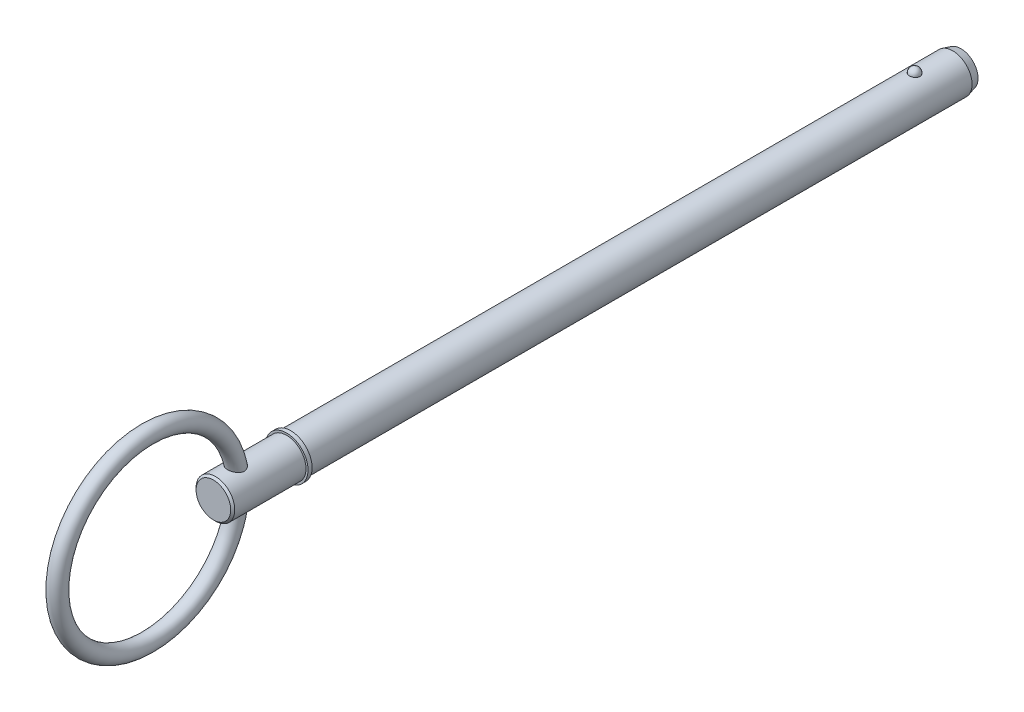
ISO-10303-21;
HEADER;
FILE_DESCRIPTION(('STEP AP214'),'2;1');
FILE_NAME('part.step','',(''),(''),'','','');
FILE_SCHEMA(('AUTOMOTIVE_DESIGN { 1 0 10303 214 1 1 1 1 }'));
ENDSEC;
DATA;
#1=APPLICATION_CONTEXT('core data for automotive mechanical design processes');
#2=APPLICATION_PROTOCOL_DEFINITION('international standard','automotive_design',2000,#1);
#3=PRODUCT_CONTEXT('',#1,'mechanical');
#4=PRODUCT('Part','Part','',(#3));
#5=PRODUCT_RELATED_PRODUCT_CATEGORY('part','',(#4));
#6=PRODUCT_DEFINITION_FORMATION('','',#4);
#7=PRODUCT_DEFINITION_CONTEXT('part definition',#1,'design');
#8=PRODUCT_DEFINITION('design','',#6,#7);
#9=PRODUCT_DEFINITION_SHAPE('','',#8);
#10=(LENGTH_UNIT() NAMED_UNIT(*) SI_UNIT(.MILLI.,.METRE.));
#11=(NAMED_UNIT(*) PLANE_ANGLE_UNIT() SI_UNIT($,.RADIAN.));
#12=(NAMED_UNIT(*) SI_UNIT($,.STERADIAN.) SOLID_ANGLE_UNIT());
#13=UNCERTAINTY_MEASURE_WITH_UNIT(LENGTH_MEASURE(1.E-05),#10,'distance_accuracy_value','');
#14=(GEOMETRIC_REPRESENTATION_CONTEXT(3) GLOBAL_UNCERTAINTY_ASSIGNED_CONTEXT((#13)) GLOBAL_UNIT_ASSIGNED_CONTEXT((#10,
#11,#12)) REPRESENTATION_CONTEXT('',''));
#15=CARTESIAN_POINT('',(0.,0.,0.));
#16=DIRECTION('',(0.,0.,1.));
#17=DIRECTION('',(1.,0.,0.));
#18=AXIS2_PLACEMENT_3D('',#15,#16,#17);
#19=CARTESIAN_POINT('',(0.,0.,152.4));
#20=DIRECTION('',(0.,0.,-1.));
#21=DIRECTION('',(-1.,0.,0.));
#22=AXIS2_PLACEMENT_3D('',#19,#20,#21);
#23=CYLINDRICAL_SURFACE('',#22,4.765);
#24=CARTESIAN_POINT('',(1.27812710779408,4.59038300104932,-1.29));
#25=CARTESIAN_POINT('',(1.27812572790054,4.59038414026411,-1.21786886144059));
#26=CARTESIAN_POINT('',(1.27223018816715,4.59203736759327,-1.14572000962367));
#27=CARTESIAN_POINT('',(1.24878929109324,4.59846646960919,-1.00346315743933));
#28=CARTESIAN_POINT('',(1.23123896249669,4.60324367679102,-0.933356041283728));
#29=CARTESIAN_POINT('',(1.18493861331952,4.61537801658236,-0.797215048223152));
#30=CARTESIAN_POINT('',(1.15619354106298,4.62273400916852,-0.731179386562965));
#31=CARTESIAN_POINT('',(1.08822596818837,4.6392032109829,-0.604986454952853));
#32=CARTESIAN_POINT('',(1.04900384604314,4.64831635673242,-0.54482897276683));
#33=CARTESIAN_POINT('',(0.960865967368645,4.66733302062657,-0.431775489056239));
#34=CARTESIAN_POINT('',(0.911906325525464,4.67723999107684,-0.378914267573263));
#35=CARTESIAN_POINT('',(0.805678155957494,4.69670280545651,-0.282245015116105));
#36=CARTESIAN_POINT('',(0.748409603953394,4.70625864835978,-0.238437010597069));
#37=CARTESIAN_POINT('',(0.627266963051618,4.72392767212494,-0.161207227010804));
#38=CARTESIAN_POINT('',(0.563411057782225,4.73204466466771,-0.127757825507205));
#39=CARTESIAN_POINT('',(0.430755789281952,4.74595788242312,-0.0720471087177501));
#40=CARTESIAN_POINT('',(0.361956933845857,4.75175434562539,-0.0497846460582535));
#41=CARTESIAN_POINT('',(0.222605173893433,4.76030056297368,-0.0173750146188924));
#42=CARTESIAN_POINT('',(0.152101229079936,4.76309991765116,-0.00703038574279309));
#43=CARTESIAN_POINT('',(0.0103009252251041,4.76551622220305,0.00191361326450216));
#44=CARTESIAN_POINT('',(-0.06099536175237,4.76513345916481,0.000514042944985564));
#45=CARTESIAN_POINT('',(-0.201348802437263,4.76125496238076,-0.0138891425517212));
#46=CARTESIAN_POINT('',(-0.270423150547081,4.75780093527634,-0.0267372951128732));
#47=CARTESIAN_POINT('',(-0.405377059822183,4.74820737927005,-0.0634598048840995));
#48=CARTESIAN_POINT('',(-0.471256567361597,4.74206780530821,-0.0873343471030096));
#49=CARTESIAN_POINT('',(-0.598375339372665,4.72771507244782,-0.14561183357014));
#50=CARTESIAN_POINT('',(-0.659587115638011,4.71949070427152,-0.180071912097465));
#51=CARTESIAN_POINT('',(-0.775356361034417,4.70185936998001,-0.258542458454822));
#52=CARTESIAN_POINT('',(-0.829913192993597,4.69245229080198,-0.30255383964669));
#53=CARTESIAN_POINT('',(-0.931895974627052,4.67327936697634,-0.399829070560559));
#54=CARTESIAN_POINT('',(-0.979176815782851,4.66351011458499,-0.453244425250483));
#55=CARTESIAN_POINT('',(-1.06421220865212,4.64484426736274,-0.567321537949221));
#56=CARTESIAN_POINT('',(-1.10196613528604,4.63594772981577,-0.627983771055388));
#57=CARTESIAN_POINT('',(-1.16735225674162,4.61992036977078,-0.755585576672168));
#58=CARTESIAN_POINT('',(-1.19487251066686,4.61280933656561,-0.822585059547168));
#59=CARTESIAN_POINT('',(-1.23851975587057,4.60128324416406,-0.960417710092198));
#60=CARTESIAN_POINT('',(-1.25464705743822,4.59686811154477,-1.03125077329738));
#61=CARTESIAN_POINT('',(-1.27505790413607,4.59124882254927,-1.17443804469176));
#62=CARTESIAN_POINT('',(-1.27938868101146,4.59003186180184,-1.246785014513));
#63=CARTESIAN_POINT('',(-1.27623192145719,4.5909105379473,-1.39119892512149));
#64=CARTESIAN_POINT('',(-1.26874468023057,4.59300609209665,-1.46326587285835));
#65=CARTESIAN_POINT('',(-1.24220427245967,4.60025423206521,-1.60473192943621));
#66=CARTESIAN_POINT('',(-1.2232043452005,4.60539274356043,-1.67414176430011));
#67=CARTESIAN_POINT('',(-1.1741591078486,4.61813957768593,-1.80870154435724));
#68=CARTESIAN_POINT('',(-1.1441133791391,4.62574799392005,-1.87385132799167));
#69=CARTESIAN_POINT('',(-1.07354327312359,4.64263368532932,-1.99841604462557));
#70=CARTESIAN_POINT('',(-1.03296580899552,4.65191934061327,-2.05779976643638));
#71=CARTESIAN_POINT('',(-0.942433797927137,4.67110036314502,-2.16881966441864));
#72=CARTESIAN_POINT('',(-0.892478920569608,4.68099575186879,-2.22045556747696));
#73=CARTESIAN_POINT('',(-0.784302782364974,4.70033161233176,-2.31471696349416));
#74=CARTESIAN_POINT('',(-0.726054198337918,4.70977043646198,-2.35731146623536));
#75=CARTESIAN_POINT('',(-0.602997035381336,4.72709995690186,-2.43206620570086));
#76=CARTESIAN_POINT('',(-0.538188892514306,4.73499075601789,-2.46422713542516));
#77=CARTESIAN_POINT('',(-0.404639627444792,4.7482563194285,-2.5168745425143));
#78=CARTESIAN_POINT('',(-0.335953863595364,4.7536596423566,-2.53749415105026));
#79=CARTESIAN_POINT('',(-0.195948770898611,4.76148510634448,-2.5670372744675));
#80=CARTESIAN_POINT('',(-0.124629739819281,4.76390758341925,-2.5759621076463));
#81=CARTESIAN_POINT('',(0.0172696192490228,4.76548774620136,-2.5818033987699));
#82=CARTESIAN_POINT('',(0.0878407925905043,4.76470225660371,-2.57892886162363));
#83=CARTESIAN_POINT('',(0.227467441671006,4.76008019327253,-2.561726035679));
#84=CARTESIAN_POINT('',(0.296522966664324,4.75624371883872,-2.5473981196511));
#85=CARTESIAN_POINT('',(0.430942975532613,4.74595041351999,-2.50776251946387));
#86=CARTESIAN_POINT('',(0.496319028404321,4.7395023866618,-2.4824917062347));
#87=CARTESIAN_POINT('',(0.621860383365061,4.72467083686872,-2.42167301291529));
#88=CARTESIAN_POINT('',(0.682025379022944,4.71628720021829,-2.38612452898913));
#89=CARTESIAN_POINT('',(0.796409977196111,4.69833598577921,-2.30511163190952));
#90=CARTESIAN_POINT('',(0.850529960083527,4.68875291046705,-2.25951003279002));
#91=CARTESIAN_POINT('',(0.950412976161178,4.66953243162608,-2.15992428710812));
#92=CARTESIAN_POINT('',(0.996174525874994,4.65989501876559,-2.1059386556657));
#93=CARTESIAN_POINT('',(1.07885962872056,4.64145616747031,-1.99009376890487));
#94=CARTESIAN_POINT('',(1.11562789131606,4.63267081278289,-1.92812106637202));
#95=CARTESIAN_POINT('',(1.17840570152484,4.61710269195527,-1.79873681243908));
#96=CARTESIAN_POINT('',(1.20441973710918,4.61031909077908,-1.73132754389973));
#97=CARTESIAN_POINT('',(1.24242116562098,4.60021170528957,-1.60192906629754));
#98=CARTESIAN_POINT('',(1.25578772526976,4.59655387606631,-1.54036674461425));
#99=CARTESIAN_POINT('',(1.27364121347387,4.59163904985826,-1.41587409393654));
#100=CARTESIAN_POINT('',(1.2781283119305,4.59038200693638,-1.35294379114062));
#101=CARTESIAN_POINT('',(1.27812710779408,4.59038300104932,-1.29));
#102=B_SPLINE_CURVE_WITH_KNOTS('',3,(#24,#25,#26,#27,#28,#29,#30,#31,#32,#33,#34,#35,#36,#37,
#38,#39,#40,#41,#42,#43,#44,#45,#46,#47,#48,#49,#50,#51,#52,#53,#54,#55,#56,#57,#58,#59,#60,#61,
#62,#63,#64,#65,#66,#67,#68,#69,#70,#71,#72,#73,#74,#75,#76,#77,#78,#79,#80,#81,#82,#83,#84,#85,
#86,#87,#88,#89,#90,#91,#92,#93,#94,#95,#96,#97,#98,#99,#100,#101),.UNSPECIFIED.,.T.,.F.,(4,2,2,
2,2,2,2,2,2,2,2,2,2,2,2,2,2,2,2,2,2,2,2,2,2,2,2,2,2,2,2,2,2,2,2,2,2,2,4),(0.,0.216167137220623,
0.432426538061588,0.648590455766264,0.8647465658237,1.0818998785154,1.29905382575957,
1.51562361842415,1.73217119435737,1.94507683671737,2.15796327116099,2.36800220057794,
2.57804465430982,2.78924132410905,3.00045819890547,3.21545551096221,3.43046692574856,
3.64776550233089,3.8650581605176,4.08147951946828,4.29789547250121,4.51331818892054,
4.72874907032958,4.94528769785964,5.16183395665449,5.37911087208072,5.59637335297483,
5.8110751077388,6.02575265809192,6.23664413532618,6.44752874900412,6.65770827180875,
6.86790014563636,7.08116060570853,7.29445887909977,7.51121476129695,7.72788009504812,
7.91651762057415,8.10515153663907),.UNSPECIFIED.);
#103=CARTESIAN_POINT('',(1.27812710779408,4.59038300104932,-1.29));
#104=VERTEX_POINT('',#103);
#105=EDGE_CURVE('E101',#104,#104,#102,.T.);
#106=ORIENTED_EDGE('',*,*,#105,.T.);
#107=EDGE_LOOP('',(#106));
#108=FACE_BOUND('',#107,.T.);
#109=CARTESIAN_POINT('',(0.,0.,-10.7000000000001));
#110=DIRECTION('',(0.,0.,-1.));
#111=DIRECTION('',(-1.,0.,0.));
#112=AXIS2_PLACEMENT_3D('',#109,#110,#111);
#113=CIRCLE('',#112,4.765);
#114=CARTESIAN_POINT('',(-4.765,0.,-10.7000000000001));
#115=VERTEX_POINT('',#114);
#116=EDGE_CURVE('E109',#115,#115,#113,.F.);
#117=ORIENTED_EDGE('',*,*,#116,.T.);
#118=EDGE_LOOP('',(#117));
#119=FACE_BOUND('',#118,.T.);
#120=CARTESIAN_POINT('',(0.,0.,152.4));
#121=DIRECTION('',(0.,0.,1.));
#122=DIRECTION('',(1.,0.,0.));
#123=AXIS2_PLACEMENT_3D('',#120,#121,#122);
#124=CIRCLE('',#123,4.765);
#125=CARTESIAN_POINT('',(4.765,0.,152.4));
#126=VERTEX_POINT('',#125);
#127=EDGE_CURVE('E107',#126,#126,#124,.T.);
#128=ORIENTED_EDGE('',*,*,#127,.F.);
#129=EDGE_LOOP('',(#128));
#130=FACE_BOUND('',#129,.T.);
#131=ADVANCED_FACE('F39',(#108,#119,#130),#23,.T.);
#132=CARTESIAN_POINT('',(0.,0.,-12.7));
#133=DIRECTION('',(0.,0.,-1.));
#134=DIRECTION('',(-1.,0.,0.));
#135=AXIS2_PLACEMENT_3D('',#132,#133,#134);
#136=PLANE('',#135);
#137=CARTESIAN_POINT('',(0.,0.,-12.7));
#138=DIRECTION('',(0.,0.,-1.));
#139=DIRECTION('',(-1.,0.,0.));
#140=AXIS2_PLACEMENT_3D('',#137,#138,#139);
#141=CIRCLE('',#140,4.22910161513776);
#142=CARTESIAN_POINT('',(-4.22910161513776,0.,-12.7));
#143=VERTEX_POINT('',#142);
#144=EDGE_CURVE('E142',#143,#143,#141,.T.);
#145=ORIENTED_EDGE('',*,*,#144,.T.);
#146=EDGE_LOOP('',(#145));
#147=FACE_BOUND('',#146,.T.);
#148=ADVANCED_FACE('F87',(#147),#136,.T.);
#149=CARTESIAN_POINT('',(0.,0.,-12.7));
#150=DIRECTION('',(0.,0.,1.));
#151=DIRECTION('',(1.,0.,0.));
#152=AXIS2_PLACEMENT_3D('',#149,#150,#151);
#153=CONICAL_SURFACE('',#152,4.22910161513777,0.261799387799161);
#154=ORIENTED_EDGE('',*,*,#116,.F.);
#155=EDGE_LOOP('',(#154));
#156=FACE_BOUND('',#155,.T.);
#157=ORIENTED_EDGE('',*,*,#144,.F.);
#158=EDGE_LOOP('',(#157));
#159=FACE_BOUND('',#158,.T.);
#160=ADVANCED_FACE('F93',(#156,#159),#153,.T.);
#161=CARTESIAN_POINT('',(0.,4.765,-1.28999999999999));
#162=DIRECTION('',(0.,1.,0.));
#163=DIRECTION('',(0.,0.,-1.));
#164=AXIS2_PLACEMENT_3D('',#161,#162,#163);
#165=SPHERICAL_SURFACE('',#164,1.29);
#166=ORIENTED_EDGE('',*,*,#105,.F.);
#167=EDGE_LOOP('',(#166));
#168=FACE_BOUND('',#167,.T.);
#169=ADVANCED_FACE('F112',(#168),#165,.T.);
#170=CARTESIAN_POINT('',(0.,0.,152.4));
#171=DIRECTION('',(0.,0.,-1.));
#172=DIRECTION('',(-1.,0.,0.));
#173=AXIS2_PLACEMENT_3D('',#170,#171,#172);
#174=PLANE('',#173);
#175=ORIENTED_EDGE('',*,*,#127,.T.);
#176=EDGE_LOOP('',(#175));
#177=FACE_BOUND('',#176,.T.);
#178=CARTESIAN_POINT('',(0.,0.,152.4));
#179=DIRECTION('',(0.,0.,-1.));
#180=DIRECTION('',(-1.,0.,0.));
#181=AXIS2_PLACEMENT_3D('',#178,#179,#180);
#182=CIRCLE('',#181,5.265);
#183=CARTESIAN_POINT('',(-5.265,0.,152.4));
#184=VERTEX_POINT('',#183);
#185=EDGE_CURVE('E108',#184,#184,#182,.T.);
#186=ORIENTED_EDGE('',*,*,#185,.T.);
#187=EDGE_LOOP('',(#186));
#188=FACE_BOUND('',#187,.T.);
#189=ADVANCED_FACE('F116',(#177,#188),#174,.T.);
#190=CARTESIAN_POINT('',(0.,0.,33.7287874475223));
#191=DIRECTION('',(0.,0.,-1.));
#192=DIRECTION('',(-1.,0.,0.));
#193=AXIS2_PLACEMENT_3D('',#190,#191,#192);
#194=CYLINDRICAL_SURFACE('',#193,5.265);
#195=CARTESIAN_POINT('',(0.,0.,153.4));
#196=DIRECTION('',(0.,0.,-1.));
#197=DIRECTION('',(-1.,0.,0.));
#198=AXIS2_PLACEMENT_3D('',#195,#196,#197);
#199=CIRCLE('',#198,5.265);
#200=CARTESIAN_POINT('',(-5.265,0.,153.4));
#201=VERTEX_POINT('',#200);
#202=EDGE_CURVE('E133',#201,#201,#199,.T.);
#203=ORIENTED_EDGE('',*,*,#202,.T.);
#204=EDGE_LOOP('',(#203));
#205=FACE_BOUND('',#204,.T.);
#206=ORIENTED_EDGE('',*,*,#185,.F.);
#207=EDGE_LOOP('',(#206));
#208=FACE_BOUND('',#207,.T.);
#209=ADVANCED_FACE('F120',(#205,#208),#194,.T.);
#210=CARTESIAN_POINT('',(0.,5.265,153.4));
#211=DIRECTION('',(0.,0.,1.));
#212=DIRECTION('',(1.,0.,0.));
#213=AXIS2_PLACEMENT_3D('',#210,#211,#212);
#214=PLANE('',#213);
#215=CARTESIAN_POINT('',(0.,0.,153.4));
#216=DIRECTION('',(0.,0.,1.));
#217=DIRECTION('',(1.,0.,0.));
#218=AXIS2_PLACEMENT_3D('',#215,#216,#217);
#219=CIRCLE('',#218,4.765);
#220=CARTESIAN_POINT('',(4.765,0.,153.4));
#221=VERTEX_POINT('',#220);
#222=EDGE_CURVE('E111',#221,#221,#219,.T.);
#223=ORIENTED_EDGE('',*,*,#222,.F.);
#224=EDGE_LOOP('',(#223));
#225=FACE_BOUND('',#224,.T.);
#226=ORIENTED_EDGE('',*,*,#202,.F.);
#227=EDGE_LOOP('',(#226));
#228=FACE_BOUND('',#227,.T.);
#229=ADVANCED_FACE('F84',(#225,#228),#214,.T.);
#230=CARTESIAN_POINT('',(0.,0.,171.45));
#231=DIRECTION('',(0.,0.,-1.));
#232=DIRECTION('',(-1.,0.,0.));
#233=AXIS2_PLACEMENT_3D('',#230,#231,#232);
#234=CYLINDRICAL_SURFACE('',#233,4.765);
#235=CARTESIAN_POINT('',(-1.1760358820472,-4.61759294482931,164.28372006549));
#236=CARTESIAN_POINT('',(-1.08605054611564,-4.64050753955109,164.2215688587));
#237=CARTESIAN_POINT('',(-0.99048657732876,-4.66202408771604,164.16673933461));
#238=CARTESIAN_POINT('',(-0.79076273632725,-4.70002969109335,164.072995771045));
#239=CARTESIAN_POINT('',(-0.68658722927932,-4.7165093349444,164.034111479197));
#240=CARTESIAN_POINT('',(-0.472539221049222,-4.74273618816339,163.973267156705));
#241=CARTESIAN_POINT('',(-0.362665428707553,-4.75248186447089,163.951310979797));
#242=CARTESIAN_POINT('',(-0.140482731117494,-4.7642267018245,163.924936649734));
#243=CARTESIAN_POINT('',(-0.0281752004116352,-4.7662301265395,163.920508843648));
#244=CARTESIAN_POINT('',(0.193745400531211,-4.76233166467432,163.929208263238));
#245=CARTESIAN_POINT('',(0.303372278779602,-4.75656024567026,163.942045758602));
#246=CARTESIAN_POINT('',(0.518724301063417,-4.73791484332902,163.984434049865));
#247=CARTESIAN_POINT('',(0.624448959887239,-4.72503997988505,164.013986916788));
#248=CARTESIAN_POINT('',(0.829434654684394,-4.69340588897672,164.08920858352));
#249=CARTESIAN_POINT('',(0.928674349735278,-4.67462830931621,164.134927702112));
#250=CARTESIAN_POINT('',(1.11777413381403,-4.63305392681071,164.241473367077));
#251=CARTESIAN_POINT('',(1.2076321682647,-4.61025624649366,164.302303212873));
#252=CARTESIAN_POINT('',(1.37762760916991,-4.56238439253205,164.439439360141));
#253=CARTESIAN_POINT('',(1.45749020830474,-4.53726959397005,164.51607281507));
#254=CARTESIAN_POINT('',(1.60275140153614,-4.48801828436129,164.682293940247));
#255=CARTESIAN_POINT('',(1.66815155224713,-4.46388166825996,164.771880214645));
#256=CARTESIAN_POINT('',(1.78162069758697,-4.41980966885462,164.960468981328));
#257=CARTESIAN_POINT('',(1.82993675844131,-4.39981628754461,165.059308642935));
#258=CARTESIAN_POINT('',(1.90902953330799,-4.36608532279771,165.264739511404));
#259=CARTESIAN_POINT('',(1.93981696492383,-4.35234391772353,165.371325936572));
#260=CARTESIAN_POINT('',(1.98181129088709,-4.33337618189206,165.582380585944));
#261=CARTESIAN_POINT('',(1.99406945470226,-4.32769391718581,165.68660066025));
#262=CARTESIAN_POINT('',(2.0025484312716,-4.32377679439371,165.895812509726));
#263=CARTESIAN_POINT('',(1.99876733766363,-4.32554282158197,166.000804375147));
#264=CARTESIAN_POINT('',(1.97595504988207,-4.33600911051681,166.209105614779));
#265=CARTESIAN_POINT('',(1.95686739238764,-4.34473504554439,166.312407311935));
#266=CARTESIAN_POINT('',(1.90457346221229,-4.36790947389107,166.514679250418));
#267=CARTESIAN_POINT('',(1.87136191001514,-4.38236010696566,166.613647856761));
#268=CARTESIAN_POINT('',(1.78747856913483,-4.41728816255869,166.816470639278));
#269=CARTESIAN_POINT('',(1.73524632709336,-4.43826528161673,166.919592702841));
#270=CARTESIAN_POINT('',(1.6160725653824,-4.48303292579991,167.116386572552));
#271=CARTESIAN_POINT('',(1.54911576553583,-4.50682636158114,167.210048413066));
#272=CARTESIAN_POINT('',(1.39359064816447,-4.55746895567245,167.395383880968));
#273=CARTESIAN_POINT('',(1.30346928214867,-4.58437060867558,167.485750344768));
#274=CARTESIAN_POINT('',(1.10794390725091,-4.6354985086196,167.649011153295));
#275=CARTESIAN_POINT('',(1.00255934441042,-4.65972809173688,167.721927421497));
#276=CARTESIAN_POINT('',(0.803761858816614,-4.69755503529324,167.832407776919));
#277=CARTESIAN_POINT('',(0.712935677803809,-4.71231838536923,167.874230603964));
#278=CARTESIAN_POINT('',(0.525172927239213,-4.73691370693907,167.942936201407));
#279=CARTESIAN_POINT('',(0.42824208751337,-4.74675022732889,167.969832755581));
#280=CARTESIAN_POINT('',(0.230351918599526,-4.76046566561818,168.007147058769));
#281=CARTESIAN_POINT('',(0.129376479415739,-4.76431768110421,168.017490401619));
#282=CARTESIAN_POINT('',(-0.0728965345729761,-4.76551495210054,168.020716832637));
#283=CARTESIAN_POINT('',(-0.174194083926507,-4.76286070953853,168.01360126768));
#284=CARTESIAN_POINT('',(-0.36646785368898,-4.75179292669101,167.983579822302));
#285=CARTESIAN_POINT('',(-0.457659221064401,-4.74381187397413,167.961858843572));
#286=CARTESIAN_POINT('',(-0.635226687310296,-4.72331548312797,167.905084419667));
#287=CARTESIAN_POINT('',(-0.721601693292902,-4.71079912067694,167.870027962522));
#288=CARTESIAN_POINT('',(-0.893212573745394,-4.68139468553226,167.785559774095));
#289=CARTESIAN_POINT('',(-0.97802747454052,-4.66427939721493,167.735377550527));
#290=CARTESIAN_POINT('',(-1.13917803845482,-4.62756330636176,167.623642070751));
#291=CARTESIAN_POINT('',(-1.21550961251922,-4.60796131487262,167.562083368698));
#292=CARTESIAN_POINT('',(-1.37033540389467,-4.56452178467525,167.41868852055));
#293=CARTESIAN_POINT('',(-1.44723650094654,-4.54050700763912,167.335184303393));
#294=CARTESIAN_POINT('',(-1.58763850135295,-4.49334232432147,167.157292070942));
#295=CARTESIAN_POINT('',(-1.65112672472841,-4.47019325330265,167.062893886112));
#296=CARTESIAN_POINT('',(-1.77033243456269,-4.42444393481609,166.853206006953));
#297=CARTESIAN_POINT('',(-1.82420433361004,-4.40224259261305,166.736768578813));
#298=CARTESIAN_POINT('',(-1.91169086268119,-4.36496831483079,166.495409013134));
#299=CARTESIAN_POINT('',(-1.94531523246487,-4.3498919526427,166.370490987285));
#300=CARTESIAN_POINT('',(-1.98892523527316,-4.33012255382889,166.122016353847));
#301=CARTESIAN_POINT('',(-1.99998275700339,-4.32495941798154,165.998689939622));
#302=CARTESIAN_POINT('',(-2.00001713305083,-4.32494814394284,165.752073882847));
#303=CARTESIAN_POINT('',(-1.98902141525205,-4.33008719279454,165.628784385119));
#304=CARTESIAN_POINT('',(-1.94752572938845,-4.34888267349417,165.40321378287));
#305=CARTESIAN_POINT('',(-1.91979754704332,-4.3613227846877,165.300310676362));
#306=CARTESIAN_POINT('',(-1.84805595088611,-4.39220107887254,165.101251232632));
#307=CARTESIAN_POINT('',(-1.80403476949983,-4.41064212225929,165.005098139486));
#308=CARTESIAN_POINT('',(-1.70232000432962,-4.45086896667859,164.824457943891));
#309=CARTESIAN_POINT('',(-1.64499853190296,-4.47255887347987,164.739738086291));
#310=CARTESIAN_POINT('',(-1.51770958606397,-4.51733419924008,164.581012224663));
#311=CARTESIAN_POINT('',(-1.44776268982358,-4.54041730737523,164.506989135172));
#312=CARTESIAN_POINT('',(-1.34143544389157,-4.57239833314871,164.41104340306));
#313=CARTESIAN_POINT('',(-1.30955259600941,-4.58164274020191,164.384115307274));
#314=CARTESIAN_POINT('',(-1.24406394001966,-4.59985727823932,164.332340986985));
#315=CARTESIAN_POINT('',(-1.21045807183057,-4.6088273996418,164.30749483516));
#316=CARTESIAN_POINT('',(-1.1760358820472,-4.61759294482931,164.28372006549));
#317=B_SPLINE_CURVE_WITH_KNOTS('',3,(#235,#236,#237,#238,#239,#240,#241,#242,#243,#244,#245,
#246,#247,#248,#249,#250,#251,#252,#253,#254,#255,#256,#257,#258,#259,#260,#261,#262,#263,#264,
#265,#266,#267,#268,#269,#270,#271,#272,#273,#274,#275,#276,#277,#278,#279,#280,#281,#282,#283,
#284,#285,#286,#287,#288,#289,#290,#291,#292,#293,#294,#295,#296,#297,#298,#299,#300,#301,#302,
#303,#304,#305,#306,#307,#308,#309,#310,#311,#312,#313,#314,#315,#316),.UNSPECIFIED.,.T.,.F.,(4,
2,2,2,2,2,2,2,2,2,2,2,2,2,2,2,2,2,2,2,2,2,2,2,2,2,2,2,2,2,2,2,2,2,2,2,2,2,2,2,4),(0.,
0.335054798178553,0.670731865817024,1.00648532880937,1.34205386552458,1.67206089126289,
2.00210881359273,2.33319321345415,2.66434996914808,3.00321157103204,3.34203668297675,
3.6757394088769,4.00923787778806,4.32299322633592,4.63678586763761,4.95174139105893,
5.26681474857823,5.61785759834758,5.96926647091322,6.35862694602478,6.747495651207,
7.04947204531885,7.35116911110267,7.65421852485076,7.95724456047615,8.23825252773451,
8.51932400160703,8.81825171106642,9.1173228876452,9.464044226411,9.81109188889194,
10.1997682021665,10.5882573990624,10.9578189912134,11.32692124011,11.6472091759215,
11.9676500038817,12.2800235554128,12.5918925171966,12.7200569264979,12.8482258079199),.UNSPECIFIED.);
#318=CARTESIAN_POINT('',(-1.1760358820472,-4.61759294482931,164.28372006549));
#319=VERTEX_POINT('',#318);
#320=EDGE_CURVE('E10',#319,#319,#317,.T.);
#321=ORIENTED_EDGE('',*,*,#320,.F.);
#322=EDGE_LOOP('',(#321));
#323=FACE_BOUND('',#322,.T.);
#324=CARTESIAN_POINT('',(-1.1760358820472,4.61759294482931,164.28372006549));
#325=CARTESIAN_POINT('',(-1.26499234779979,4.59493450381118,164.345169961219));
#326=CARTESIAN_POINT('',(-1.34870034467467,4.5708599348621,164.413915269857));
#327=CARTESIAN_POINT('',(-1.50334626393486,4.52236448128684,164.564635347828));
#328=CARTESIAN_POINT('',(-1.57425996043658,4.49794303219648,164.646634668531));
#329=CARTESIAN_POINT('',(-1.70130187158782,4.45144771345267,164.822234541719));
#330=CARTESIAN_POINT('',(-1.75740699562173,4.42937754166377,164.91585288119));
#331=CARTESIAN_POINT('',(-1.85287755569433,4.39030189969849,165.112166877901));
#332=CARTESIAN_POINT('',(-1.8922587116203,4.37329167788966,165.214853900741));
#333=CARTESIAN_POINT('',(-1.95188661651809,4.34699775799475,165.421857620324));
#334=CARTESIAN_POINT('',(-1.97286468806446,4.33742068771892,165.525926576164));
#335=CARTESIAN_POINT('',(-1.99814509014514,4.32583397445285,165.736471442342));
#336=CARTESIAN_POINT('',(-2.00244696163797,4.32382453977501,165.842947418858));
#337=CARTESIAN_POINT('',(-1.99499900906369,4.32726361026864,166.052770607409));
#338=CARTESIAN_POINT('',(-1.9836061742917,4.33254625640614,166.156134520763));
#339=CARTESIAN_POINT('',(-1.9464361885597,4.34936983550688,166.359691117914));
#340=CARTESIAN_POINT('',(-1.92065444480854,4.36091276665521,166.459882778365));
#341=CARTESIAN_POINT('',(-1.85292379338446,4.39014527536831,166.66410420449));
#342=CARTESIAN_POINT('',(-1.80971134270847,4.40830066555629,166.767646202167));
#343=CARTESIAN_POINT('',(-1.70892742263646,4.44833985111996,166.966768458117));
#344=CARTESIAN_POINT('',(-1.65134284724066,4.47022704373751,167.062341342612));
#345=CARTESIAN_POINT('',(-1.51475300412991,4.51847764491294,167.255260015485));
#346=CARTESIAN_POINT('',(-1.4339566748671,4.54505660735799,167.351291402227));
#347=CARTESIAN_POINT('',(-1.25684082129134,4.59718102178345,167.528132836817));
#348=CARTESIAN_POINT('',(-1.16053129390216,4.6227271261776,167.608952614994));
#349=CARTESIAN_POINT('',(-0.972192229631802,4.66558476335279,167.739326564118));
#350=CARTESIAN_POINT('',(-0.882391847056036,4.68355428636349,167.791879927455));
#351=CARTESIAN_POINT('',(-0.694836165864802,4.71502283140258,167.882022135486));
#352=CARTESIAN_POINT('',(-0.597087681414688,4.72852563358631,167.919623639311));
#353=CARTESIAN_POINT('',(-0.395321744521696,4.74966109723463,167.977875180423));
#354=CARTESIAN_POINT('',(-0.291269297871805,4.7572569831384,167.998419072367));
#355=CARTESIAN_POINT('',(-0.0808979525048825,4.76547327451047,168.020624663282));
#356=CARTESIAN_POINT('',(0.0254198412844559,4.76609700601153,168.02229536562));
#357=CARTESIAN_POINT('',(0.225327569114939,4.7606097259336,168.007485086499));
#358=CARTESIAN_POINT('',(0.319084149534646,4.75519734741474,167.992887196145));
#359=CARTESIAN_POINT('',(0.502750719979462,4.73930039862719,167.949397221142));
#360=CARTESIAN_POINT('',(0.592660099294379,4.7288150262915,167.920502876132));
#361=CARTESIAN_POINT('',(0.768777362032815,4.70343779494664,167.84904136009));
#362=CARTESIAN_POINT('',(0.854839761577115,4.68844387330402,167.806155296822));
#363=CARTESIAN_POINT('',(1.01943666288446,4.65543047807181,167.708746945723));
#364=CARTESIAN_POINT('',(1.09796821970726,4.63740982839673,167.654220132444));
#365=CARTESIAN_POINT('',(1.25751825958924,4.59691257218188,167.526465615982));
#366=CARTESIAN_POINT('',(1.3372110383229,4.57417011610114,167.451667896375));
#367=CARTESIAN_POINT('',(1.48461190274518,4.52847869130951,167.291082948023));
#368=CARTESIAN_POINT('',(1.55230949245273,4.50552956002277,167.205286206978));
#369=CARTESIAN_POINT('',(1.68366050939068,4.45825797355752,167.011404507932));
#370=CARTESIAN_POINT('',(1.74532014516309,4.43421533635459,166.901889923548));
#371=CARTESIAN_POINT('',(1.85007805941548,4.39154308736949,166.673269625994));
#372=CARTESIAN_POINT('',(1.89317429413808,4.37291407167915,166.554162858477));
#373=CARTESIAN_POINT('',(1.958572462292,4.34402041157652,166.309763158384));
#374=CARTESIAN_POINT('',(1.98095022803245,4.33372528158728,166.184494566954));
#375=CARTESIAN_POINT('',(2.00301292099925,4.32358016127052,165.931594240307));
#376=CARTESIAN_POINT('',(2.00273000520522,4.32371536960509,165.803966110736));
#377=CARTESIAN_POINT('',(1.97997568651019,4.3341693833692,165.568247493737));
#378=CARTESIAN_POINT('',(1.96044562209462,4.34313814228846,165.459806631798));
#379=CARTESIAN_POINT('',(1.903681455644,4.3683153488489,165.248543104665));
#380=CARTESIAN_POINT('',(1.86644884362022,4.38452318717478,165.145719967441));
#381=CARTESIAN_POINT('',(1.77811542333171,4.42104679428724,164.95471002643));
#382=CARTESIAN_POINT('',(1.72797707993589,4.44105894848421,164.866015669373));
#383=CARTESIAN_POINT('',(1.61439500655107,4.48359504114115,164.698286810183));
#384=CARTESIAN_POINT('',(1.55094927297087,4.50611935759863,164.619253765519));
#385=CARTESIAN_POINT('',(1.40889349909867,4.55259151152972,164.468705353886));
#386=CARTESIAN_POINT('',(1.32968750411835,4.57655455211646,164.397757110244));
#387=CARTESIAN_POINT('',(1.16035884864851,4.62238936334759,164.269506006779));
#388=CARTESIAN_POINT('',(1.07023361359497,4.64426063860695,164.21220637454));
#389=CARTESIAN_POINT('',(0.877362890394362,4.68460759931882,164.110316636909));
#390=CARTESIAN_POINT('',(0.77424981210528,4.70290564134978,164.066349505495));
#391=CARTESIAN_POINT('',(0.561430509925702,4.73302876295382,163.995484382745));
#392=CARTESIAN_POINT('',(0.45172542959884,4.74485496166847,163.968583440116));
#393=CARTESIAN_POINT('',(0.230282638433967,4.76071009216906,163.932763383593));
#394=CARTESIAN_POINT('',(0.118587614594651,4.76483485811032,163.923623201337));
#395=CARTESIAN_POINT('',(-0.104911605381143,4.76515532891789,163.922908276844));
#396=CARTESIAN_POINT('',(-0.216715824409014,4.76134861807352,163.931338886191));
#397=CARTESIAN_POINT('',(-0.435231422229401,4.74632552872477,163.96524563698));
#398=CARTESIAN_POINT('',(-0.541996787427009,4.73523460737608,163.990433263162));
#399=CARTESIAN_POINT('',(-0.749371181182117,4.70686626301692,164.056921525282));
#400=CARTESIAN_POINT('',(-0.849990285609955,4.68959930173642,164.098194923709));
#401=CARTESIAN_POINT('',(-0.986108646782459,4.6620261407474,164.167235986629));
#402=CARTESIAN_POINT('',(-1.02525769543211,4.65355983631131,164.188772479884));
#403=CARTESIAN_POINT('',(-1.10191286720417,4.63600664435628,164.234367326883));
#404=CARTESIAN_POINT('',(-1.13941901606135,4.62691976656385,164.258425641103));
#405=CARTESIAN_POINT('',(-1.1760358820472,4.61759294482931,164.28372006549));
#406=B_SPLINE_CURVE_WITH_KNOTS('',3,(#324,#325,#326,#327,#328,#329,#330,#331,#332,#333,#334,
#335,#336,#337,#338,#339,#340,#341,#342,#343,#344,#345,#346,#347,#348,#349,#350,#351,#352,#353,
#354,#355,#356,#357,#358,#359,#360,#361,#362,#363,#364,#365,#366,#367,#368,#369,#370,#371,#372,
#373,#374,#375,#376,#377,#378,#379,#380,#381,#382,#383,#384,#385,#386,#387,#388,#389,#390,#391,
#392,#393,#394,#395,#396,#397,#398,#399,#400,#401,#402,#403,#404,#405),.UNSPECIFIED.,.T.,.F.,(4,
2,2,2,2,2,2,2,2,2,2,2,2,2,2,2,2,2,2,2,2,2,2,2,2,2,2,2,2,2,2,2,2,2,2,2,2,2,2,2,4),(0.,
0.331234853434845,0.663090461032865,0.995460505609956,1.32751743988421,1.64568783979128,
1.96386699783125,2.27492717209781,2.58608669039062,2.9257199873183,3.26566413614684,
3.6487519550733,4.03159388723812,4.34706664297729,4.66227172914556,4.97942386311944,
5.29642469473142,5.58021908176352,5.86405835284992,6.15488068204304,6.44581627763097,
6.77943874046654,7.11335170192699,7.49545660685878,7.87760356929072,8.25834622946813,
8.63854860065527,8.96843568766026,9.29829501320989,9.60842872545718,9.91860916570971,
10.2441707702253,10.5698092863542,10.9089029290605,11.2479379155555,11.5827251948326,
11.9176144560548,12.2468820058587,12.5755944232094,12.7119417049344,12.8482868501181),.UNSPECIFIED.);
#407=CARTESIAN_POINT('',(-1.1760358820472,4.61759294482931,164.28372006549));
#408=VERTEX_POINT('',#407);
#409=EDGE_CURVE('E51',#408,#408,#406,.T.);
#410=ORIENTED_EDGE('',*,*,#409,.F.);
#411=EDGE_LOOP('',(#410));
#412=FACE_BOUND('',#411,.T.);
#413=CARTESIAN_POINT('',(0.,0.,170.95));
#414=DIRECTION('',(0.,0.,-1.));
#415=DIRECTION('',(-1.,0.,0.));
#416=AXIS2_PLACEMENT_3D('',#413,#414,#415);
#417=CIRCLE('',#416,4.765);
#418=CARTESIAN_POINT('',(-4.765,0.,170.95));
#419=VERTEX_POINT('',#418);
#420=EDGE_CURVE('E63',#419,#419,#417,.T.);
#421=ORIENTED_EDGE('',*,*,#420,.T.);
#422=EDGE_LOOP('',(#421));
#423=FACE_BOUND('',#422,.T.);
#424=ORIENTED_EDGE('',*,*,#222,.T.);
#425=EDGE_LOOP('',(#424));
#426=FACE_BOUND('',#425,.T.);
#427=ADVANCED_FACE('F68',(#323,#412,#423,#426),#234,.T.);
#428=CARTESIAN_POINT('',(0.,0.,171.45));
#429=DIRECTION('',(0.,0.,-1.));
#430=DIRECTION('',(-1.,0.,0.));
#431=AXIS2_PLACEMENT_3D('',#428,#429,#430);
#432=PLANE('',#431);
#433=CARTESIAN_POINT('',(0.,0.,171.45));
#434=DIRECTION('',(0.,0.,-1.));
#435=DIRECTION('',(-1.,0.,0.));
#436=AXIS2_PLACEMENT_3D('',#433,#434,#435);
#437=CIRCLE('',#436,4.26499999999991);
#438=CARTESIAN_POINT('',(-4.26499999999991,0.,171.45));
#439=VERTEX_POINT('',#438);
#440=EDGE_CURVE('E58',#439,#439,#437,.F.);
#441=ORIENTED_EDGE('',*,*,#440,.T.);
#442=EDGE_LOOP('',(#441));
#443=FACE_BOUND('',#442,.T.);
#444=ADVANCED_FACE('F75',(#443),#432,.F.);
#445=CARTESIAN_POINT('',(0.,0.,170.95));
#446=DIRECTION('',(0.,0.,-1.));
#447=DIRECTION('',(-1.,0.,0.));
#448=AXIS2_PLACEMENT_3D('',#445,#446,#447);
#449=CONICAL_SURFACE('',#448,4.765,0.785398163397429);
#450=ORIENTED_EDGE('',*,*,#440,.F.);
#451=EDGE_LOOP('',(#450));
#452=FACE_BOUND('',#451,.T.);
#453=ORIENTED_EDGE('',*,*,#420,.F.);
#454=EDGE_LOOP('',(#453));
#455=FACE_BOUND('',#454,.T.);
#456=ADVANCED_FACE('F41',(#452,#455),#449,.T.);
#457=CARTESIAN_POINT('',(0.,0.,187.675));
#458=DIRECTION('',(1.,0.,0.));
#459=DIRECTION('',(0.,0.,-1.));
#460=AXIS2_PLACEMENT_3D('',#457,#458,#459);
#461=TOROIDAL_SURFACE('',#460,22.225,2.);
#462=ORIENTED_EDGE('',*,*,#320,.T.);
#463=EDGE_LOOP('',(#462));
#464=FACE_BOUND('',#463,.T.);
#465=ORIENTED_EDGE('',*,*,#409,.T.);
#466=EDGE_LOOP('',(#465));
#467=FACE_BOUND('',#466,.T.);
#468=ADVANCED_FACE('F72',(#464,#467),#461,.T.);
#469=CLOSED_SHELL('',(#131,#148,#160,#169,#189,#209,#229,#427,#444,#456,#468));
#470=MANIFOLD_SOLID_BREP('B2',#469);
#471=ADVANCED_BREP_SHAPE_REPRESENTATION('',(#18,#470),#14);
#472=SHAPE_DEFINITION_REPRESENTATION(#9,#471);
ENDSEC;
END-ISO-10303-21;
